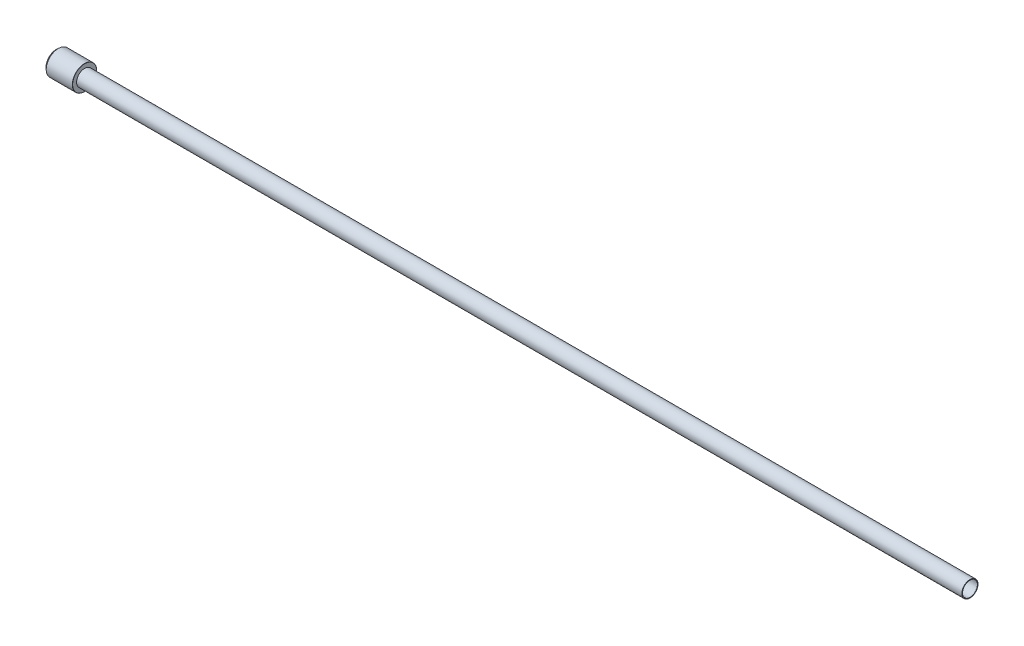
from build123d import *

# Parameters (mm, degrees)
FILLET2_R = 0.1


with BuildPart() as part:
    # Sketch1 → Revolve1 (revolve)
    with BuildSketch(Plane.XY, mode=Mode.PRIVATE) as revolve1_sk:
        Polygon((1.064, 6), (12, 6), (14, 6), (14, 3.9751), (450, 3.9751), (450, 3.6576), (0, 3.6576), (0, 5.036), (0.1, 5.036), align=None)
    revolve(revolve1_sk.sketch.rotate(Axis((-22.212185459, 0, 0), (1, 0, 0)), 90), axis=Axis((-22.212185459, 0, 0), (1, 0, 0)))

    # Fillet2
    fillet2_edges = [part.edges().sort_by_distance(p)[0] for p in [
        (14, 0, -6),
    ]]
    fillet(fillet2_edges, radius=FILLET2_R)


solid = part.part
